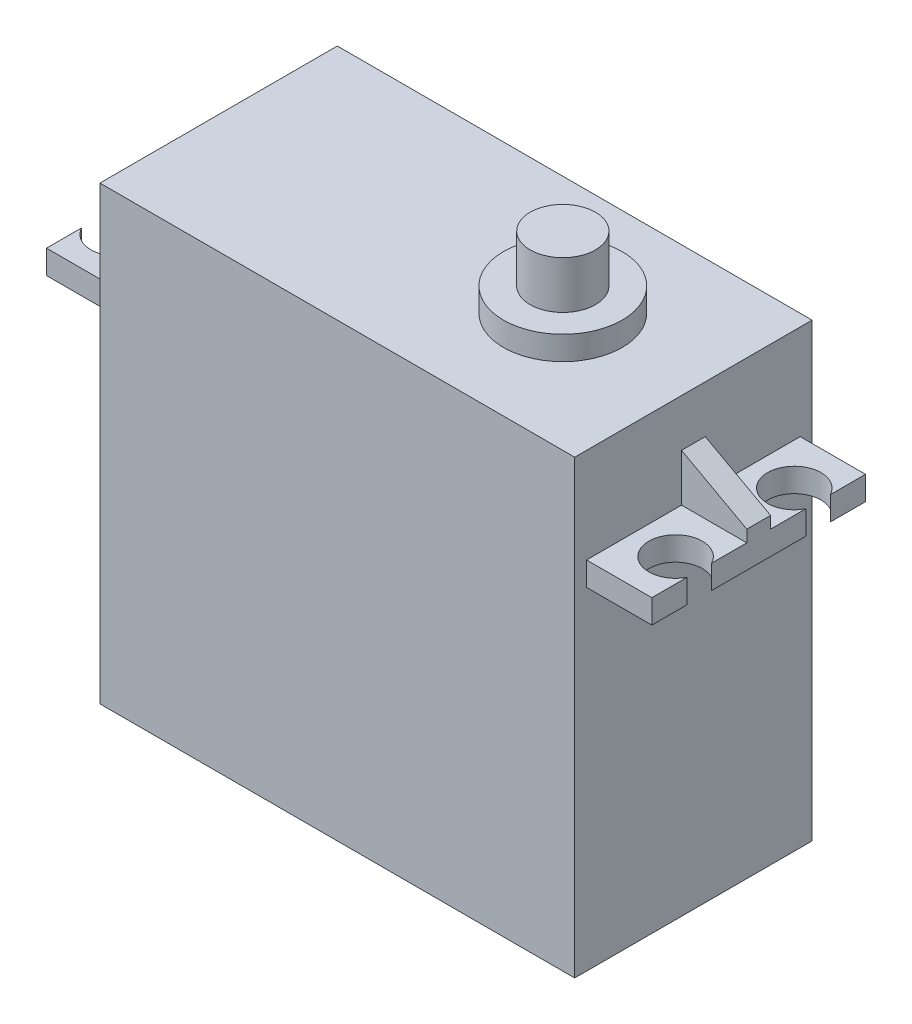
ISO-10303-21;
HEADER;
FILE_DESCRIPTION(('STEP AP214'),'2;1');
FILE_NAME('part.step','',(''),(''),'','','');
FILE_SCHEMA(('AUTOMOTIVE_DESIGN { 1 0 10303 214 1 1 1 1 }'));
ENDSEC;
DATA;
#1=APPLICATION_CONTEXT('core data for automotive mechanical design processes');
#2=APPLICATION_PROTOCOL_DEFINITION('international standard','automotive_design',2000,#1);
#3=PRODUCT_CONTEXT('',#1,'mechanical');
#4=PRODUCT('Part','Part','',(#3));
#5=PRODUCT_RELATED_PRODUCT_CATEGORY('part','',(#4));
#6=PRODUCT_DEFINITION_FORMATION('','',#4);
#7=PRODUCT_DEFINITION_CONTEXT('part definition',#1,'design');
#8=PRODUCT_DEFINITION('design','',#6,#7);
#9=PRODUCT_DEFINITION_SHAPE('','',#8);
#10=(LENGTH_UNIT() NAMED_UNIT(*) SI_UNIT(.MILLI.,.METRE.));
#11=(NAMED_UNIT(*) PLANE_ANGLE_UNIT() SI_UNIT($,.RADIAN.));
#12=(NAMED_UNIT(*) SI_UNIT($,.STERADIAN.) SOLID_ANGLE_UNIT());
#13=UNCERTAINTY_MEASURE_WITH_UNIT(LENGTH_MEASURE(1.E-05),#10,'distance_accuracy_value','');
#14=(GEOMETRIC_REPRESENTATION_CONTEXT(3) GLOBAL_UNCERTAINTY_ASSIGNED_CONTEXT((#13)) GLOBAL_UNIT_ASSIGNED_CONTEXT((#10,
#11,#12)) REPRESENTATION_CONTEXT('',''));
#15=CARTESIAN_POINT('',(0.,0.,0.));
#16=DIRECTION('',(0.,0.,1.));
#17=DIRECTION('',(1.,0.,0.));
#18=AXIS2_PLACEMENT_3D('',#15,#16,#17);
#19=CARTESIAN_POINT('',(0.,30.,0.));
#20=DIRECTION('',(0.,1.,0.));
#21=DIRECTION('',(0.,0.,1.));
#22=AXIS2_PLACEMENT_3D('',#19,#20,#21);
#23=PLANE('',#22);
#24=DIRECTION('',(0.,0.,-1.));
#25=VECTOR('',#24,1.);
#26=CARTESIAN_POINT('',(20.,30.,0.));
#27=LINE('',#26,#25);
#28=CARTESIAN_POINT('',(20.,30.,-1.));
#29=VERTEX_POINT('',#28);
#30=CARTESIAN_POINT('',(20.,30.,-9.));
#31=VERTEX_POINT('',#30);
#32=EDGE_CURVE('E296',#29,#31,#27,.T.);
#33=ORIENTED_EDGE('',*,*,#32,.F.);
#34=DIRECTION('',(1.,0.,0.));
#35=VECTOR('',#34,1.);
#36=CARTESIAN_POINT('',(0.,30.,-1.));
#37=LINE('',#36,#35);
#38=CARTESIAN_POINT('',(25.5,30.,-1.));
#39=VERTEX_POINT('',#38);
#40=EDGE_CURVE('E244',#29,#39,#37,.T.);
#41=ORIENTED_EDGE('',*,*,#40,.T.);
#42=DIRECTION('',(0.,0.,1.));
#43=VECTOR('',#42,1.);
#44=CARTESIAN_POINT('',(25.5,30.,0.));
#45=LINE('',#44,#43);
#46=CARTESIAN_POINT('',(25.5,30.,-3.96922359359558));
#47=VERTEX_POINT('',#46);
#48=EDGE_CURVE('E287',#47,#39,#45,.T.);
#49=ORIENTED_EDGE('',*,*,#48,.F.);
#50=CARTESIAN_POINT('',(23.5,30.,-5.));
#51=DIRECTION('',(0.,1.,0.));
#52=DIRECTION('',(0.,0.,1.));
#53=AXIS2_PLACEMENT_3D('',#50,#51,#52);
#54=CIRCLE('',#53,2.25);
#55=CARTESIAN_POINT('',(25.5,30.,-6.03077640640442));
#56=VERTEX_POINT('',#55);
#57=EDGE_CURVE('E289',#47,#56,#54,.F.);
#58=ORIENTED_EDGE('',*,*,#57,.T.);
#59=CARTESIAN_POINT('',(25.5,30.,-9.));
#60=VERTEX_POINT('',#59);
#61=EDGE_CURVE('E291',#60,#56,#45,.T.);
#62=ORIENTED_EDGE('',*,*,#61,.F.);
#63=DIRECTION('',(1.,0.,0.));
#64=VECTOR('',#63,1.);
#65=CARTESIAN_POINT('',(0.,30.,-9.));
#66=LINE('',#65,#64);
#67=EDGE_CURVE('E293',#31,#60,#66,.T.);
#68=ORIENTED_EDGE('',*,*,#67,.F.);
#69=EDGE_LOOP('',(#33,#41,#49,#58,#62,#68));
#70=FACE_BOUND('',#69,.T.);
#71=ADVANCED_FACE('F39',(#70),#23,.T.);
#72=CARTESIAN_POINT('',(0.,30.,0.));
#73=DIRECTION('',(0.,1.,0.));
#74=DIRECTION('',(0.,0.,1.));
#75=AXIS2_PLACEMENT_3D('',#72,#73,#74);
#76=PLANE('',#75);
#77=DIRECTION('',(0.,0.,1.));
#78=VECTOR('',#77,1.);
#79=CARTESIAN_POINT('',(-25.5,30.,0.));
#80=LINE('',#79,#78);
#81=CARTESIAN_POINT('',(-25.5,30.,-3.96922359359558));
#82=VERTEX_POINT('',#81);
#83=CARTESIAN_POINT('',(-25.5,30.,-1.));
#84=VERTEX_POINT('',#83);
#85=EDGE_CURVE('E342',#82,#84,#80,.T.);
#86=ORIENTED_EDGE('',*,*,#85,.T.);
#87=DIRECTION('',(1.,0.,0.));
#88=VECTOR('',#87,1.);
#89=CARTESIAN_POINT('',(0.,30.,-1.));
#90=LINE('',#89,#88);
#91=CARTESIAN_POINT('',(-20.,30.,-1.));
#92=VERTEX_POINT('',#91);
#93=EDGE_CURVE('E275',#84,#92,#90,.T.);
#94=ORIENTED_EDGE('',*,*,#93,.T.);
#95=DIRECTION('',(0.,0.,1.));
#96=VECTOR('',#95,1.);
#97=CARTESIAN_POINT('',(-20.,30.,0.));
#98=LINE('',#97,#96);
#99=CARTESIAN_POINT('',(-20.,30.,-9.));
#100=VERTEX_POINT('',#99);
#101=EDGE_CURVE('E353',#100,#92,#98,.T.);
#102=ORIENTED_EDGE('',*,*,#101,.F.);
#103=DIRECTION('',(-1.,0.,0.));
#104=VECTOR('',#103,1.);
#105=CARTESIAN_POINT('',(0.,30.,-9.));
#106=LINE('',#105,#104);
#107=CARTESIAN_POINT('',(-25.5,30.,-9.));
#108=VERTEX_POINT('',#107);
#109=EDGE_CURVE('E356',#100,#108,#106,.T.);
#110=ORIENTED_EDGE('',*,*,#109,.T.);
#111=CARTESIAN_POINT('',(-25.5,30.,-6.03077640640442));
#112=VERTEX_POINT('',#111);
#113=EDGE_CURVE('E358',#108,#112,#80,.T.);
#114=ORIENTED_EDGE('',*,*,#113,.T.);
#115=CARTESIAN_POINT('',(-23.5,30.,-5.));
#116=DIRECTION('',(0.,1.,0.));
#117=DIRECTION('',(0.,0.,1.));
#118=AXIS2_PLACEMENT_3D('',#115,#116,#117);
#119=CIRCLE('',#118,2.25);
#120=EDGE_CURVE('E359',#82,#112,#119,.T.);
#121=ORIENTED_EDGE('',*,*,#120,.F.);
#122=EDGE_LOOP('',(#86,#94,#102,#110,#114,#121));
#123=FACE_BOUND('',#122,.T.);
#124=ADVANCED_FACE('F467',(#123),#76,.T.);
#125=CARTESIAN_POINT('',(20.,38.,10.));
#126=DIRECTION('',(-1.,0.,0.));
#127=DIRECTION('',(0.,0.,1.));
#128=AXIS2_PLACEMENT_3D('',#125,#126,#127);
#129=PLANE('',#128);
#130=DIRECTION('',(0.,-1.,0.));
#131=VECTOR('',#130,1.);
#132=CARTESIAN_POINT('',(20.,30.,-9.));
#133=LINE('',#132,#131);
#134=CARTESIAN_POINT('',(20.,28.,-9.));
#135=VERTEX_POINT('',#134);
#136=EDGE_CURVE('E332',#31,#135,#133,.T.);
#137=ORIENTED_EDGE('',*,*,#136,.T.);
#138=DIRECTION('',(0.,0.,-1.));
#139=VECTOR('',#138,1.);
#140=CARTESIAN_POINT('',(20.,28.,0.));
#141=LINE('',#140,#139);
#142=CARTESIAN_POINT('',(20.,28.,9.));
#143=VERTEX_POINT('',#142);
#144=EDGE_CURVE('E316',#143,#135,#141,.T.);
#145=ORIENTED_EDGE('',*,*,#144,.F.);
#146=DIRECTION('',(0.,-1.,0.));
#147=VECTOR('',#146,1.);
#148=CARTESIAN_POINT('',(20.,30.,9.));
#149=LINE('',#148,#147);
#150=CARTESIAN_POINT('',(20.,30.,9.));
#151=VERTEX_POINT('',#150);
#152=EDGE_CURVE('E329',#151,#143,#149,.T.);
#153=ORIENTED_EDGE('',*,*,#152,.F.);
#154=CARTESIAN_POINT('',(20.,30.,1.));
#155=VERTEX_POINT('',#154);
#156=EDGE_CURVE('E297',#151,#155,#27,.T.);
#157=ORIENTED_EDGE('',*,*,#156,.T.);
#158=DIRECTION('',(0.,1.,0.));
#159=VECTOR('',#158,1.);
#160=CARTESIAN_POINT('',(20.,38.,0.999999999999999));
#161=LINE('',#160,#159);
#162=CARTESIAN_POINT('',(20.,34.,1.));
#163=VERTEX_POINT('',#162);
#164=EDGE_CURVE('E259',#155,#163,#161,.T.);
#165=ORIENTED_EDGE('',*,*,#164,.T.);
#166=DIRECTION('',(0.,0.,-1.));
#167=VECTOR('',#166,1.);
#168=CARTESIAN_POINT('',(20.,34.,10.));
#169=LINE('',#168,#167);
#170=CARTESIAN_POINT('',(20.,34.,-1.));
#171=VERTEX_POINT('',#170);
#172=EDGE_CURVE('E248',#163,#171,#169,.T.);
#173=ORIENTED_EDGE('',*,*,#172,.T.);
#174=DIRECTION('',(0.,1.,0.));
#175=VECTOR('',#174,1.);
#176=CARTESIAN_POINT('',(20.,38.,-0.999999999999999));
#177=LINE('',#176,#175);
#178=EDGE_CURVE('E256',#29,#171,#177,.T.);
#179=ORIENTED_EDGE('',*,*,#178,.F.);
#180=ORIENTED_EDGE('',*,*,#32,.T.);
#181=EDGE_LOOP('',(#137,#145,#153,#157,#165,#173,#179,#180));
#182=FACE_BOUND('',#181,.T.);
#183=DIRECTION('',(0.,0.,-1.));
#184=VECTOR('',#183,1.);
#185=CARTESIAN_POINT('',(20.,0.,10.));
#186=LINE('',#185,#184);
#187=CARTESIAN_POINT('',(20.,0.,10.));
#188=VERTEX_POINT('',#187);
#189=CARTESIAN_POINT('',(20.,0.,-10.));
#190=VERTEX_POINT('',#189);
#191=EDGE_CURVE('E398',#188,#190,#186,.T.);
#192=ORIENTED_EDGE('',*,*,#191,.T.);
#193=DIRECTION('',(0.,-1.,0.));
#194=VECTOR('',#193,1.);
#195=CARTESIAN_POINT('',(20.,38.,-10.));
#196=LINE('',#195,#194);
#197=CARTESIAN_POINT('',(20.,38.,-10.));
#198=VERTEX_POINT('',#197);
#199=EDGE_CURVE('E422',#198,#190,#196,.T.);
#200=ORIENTED_EDGE('',*,*,#199,.F.);
#201=DIRECTION('',(0.,0.,-1.));
#202=VECTOR('',#201,1.);
#203=CARTESIAN_POINT('',(20.,38.,10.));
#204=LINE('',#203,#202);
#205=CARTESIAN_POINT('',(20.,38.,10.));
#206=VERTEX_POINT('',#205);
#207=EDGE_CURVE('E399',#206,#198,#204,.T.);
#208=ORIENTED_EDGE('',*,*,#207,.F.);
#209=DIRECTION('',(0.,-1.,0.));
#210=VECTOR('',#209,1.);
#211=CARTESIAN_POINT('',(20.,38.,10.));
#212=LINE('',#211,#210);
#213=EDGE_CURVE('E408',#206,#188,#212,.T.);
#214=ORIENTED_EDGE('',*,*,#213,.T.);
#215=EDGE_LOOP('',(#192,#200,#208,#214));
#216=FACE_BOUND('',#215,.T.);
#217=ADVANCED_FACE('F41',(#182,#216),#129,.F.);
#218=CARTESIAN_POINT('',(-20.,38.,-10.));
#219=DIRECTION('',(0.,0.,1.));
#220=DIRECTION('',(1.,0.,0.));
#221=AXIS2_PLACEMENT_3D('',#218,#219,#220);
#222=PLANE('',#221);
#223=DIRECTION('',(-1.,0.,0.));
#224=VECTOR('',#223,1.);
#225=CARTESIAN_POINT('',(-20.,0.,-10.));
#226=LINE('',#225,#224);
#227=CARTESIAN_POINT('',(-20.,0.,-10.));
#228=VERTEX_POINT('',#227);
#229=EDGE_CURVE('E410',#190,#228,#226,.T.);
#230=ORIENTED_EDGE('',*,*,#229,.T.);
#231=DIRECTION('',(0.,-1.,0.));
#232=VECTOR('',#231,1.);
#233=CARTESIAN_POINT('',(-20.,38.,-10.));
#234=LINE('',#233,#232);
#235=CARTESIAN_POINT('',(-20.,38.,-10.));
#236=VERTEX_POINT('',#235);
#237=EDGE_CURVE('E420',#236,#228,#234,.T.);
#238=ORIENTED_EDGE('',*,*,#237,.F.);
#239=DIRECTION('',(-1.,0.,0.));
#240=VECTOR('',#239,1.);
#241=CARTESIAN_POINT('',(-20.,38.,-10.));
#242=LINE('',#241,#240);
#243=EDGE_CURVE('E401',#198,#236,#242,.T.);
#244=ORIENTED_EDGE('',*,*,#243,.F.);
#245=ORIENTED_EDGE('',*,*,#199,.T.);
#246=EDGE_LOOP('',(#230,#238,#244,#245));
#247=FACE_BOUND('',#246,.T.);
#248=ADVANCED_FACE('F451',(#247),#222,.F.);
#249=CARTESIAN_POINT('',(-20.,38.,10.));
#250=DIRECTION('',(1.,0.,0.));
#251=DIRECTION('',(0.,0.,-1.));
#252=AXIS2_PLACEMENT_3D('',#249,#250,#251);
#253=PLANE('',#252);
#254=DIRECTION('',(0.,0.,-1.));
#255=VECTOR('',#254,1.);
#256=CARTESIAN_POINT('',(-20.,34.,10.));
#257=LINE('',#256,#255);
#258=CARTESIAN_POINT('',(-20.,34.,-1.));
#259=VERTEX_POINT('',#258);
#260=CARTESIAN_POINT('',(-20.,34.,1.));
#261=VERTEX_POINT('',#260);
#262=EDGE_CURVE('E282',#259,#261,#257,.F.);
#263=ORIENTED_EDGE('',*,*,#262,.T.);
#264=DIRECTION('',(0.,-1.,0.));
#265=VECTOR('',#264,1.);
#266=CARTESIAN_POINT('',(-20.,38.,0.999999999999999));
#267=LINE('',#266,#265);
#268=CARTESIAN_POINT('',(-20.,30.,1.));
#269=VERTEX_POINT('',#268);
#270=EDGE_CURVE('E279',#261,#269,#267,.T.);
#271=ORIENTED_EDGE('',*,*,#270,.T.);
#272=CARTESIAN_POINT('',(-20.,30.,9.));
#273=VERTEX_POINT('',#272);
#274=EDGE_CURVE('E352',#269,#273,#98,.T.);
#275=ORIENTED_EDGE('',*,*,#274,.T.);
#276=DIRECTION('',(0.,-1.,0.));
#277=VECTOR('',#276,1.);
#278=CARTESIAN_POINT('',(-20.,30.,9.));
#279=LINE('',#278,#277);
#280=CARTESIAN_POINT('',(-20.,28.,9.));
#281=VERTEX_POINT('',#280);
#282=EDGE_CURVE('E387',#273,#281,#279,.T.);
#283=ORIENTED_EDGE('',*,*,#282,.T.);
#284=DIRECTION('',(0.,0.,1.));
#285=VECTOR('',#284,1.);
#286=CARTESIAN_POINT('',(-20.,28.,0.));
#287=LINE('',#286,#285);
#288=CARTESIAN_POINT('',(-20.,28.,-9.));
#289=VERTEX_POINT('',#288);
#290=EDGE_CURVE('E371',#289,#281,#287,.T.);
#291=ORIENTED_EDGE('',*,*,#290,.F.);
#292=DIRECTION('',(0.,-1.,0.));
#293=VECTOR('',#292,1.);
#294=CARTESIAN_POINT('',(-20.,30.,-9.));
#295=LINE('',#294,#293);
#296=EDGE_CURVE('E384',#100,#289,#295,.T.);
#297=ORIENTED_EDGE('',*,*,#296,.F.);
#298=ORIENTED_EDGE('',*,*,#101,.T.);
#299=DIRECTION('',(0.,-1.,0.));
#300=VECTOR('',#299,1.);
#301=CARTESIAN_POINT('',(-20.,38.,-0.999999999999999));
#302=LINE('',#301,#300);
#303=EDGE_CURVE('E63',#259,#92,#302,.T.);
#304=ORIENTED_EDGE('',*,*,#303,.F.);
#305=EDGE_LOOP('',(#263,#271,#275,#283,#291,#297,#298,#304));
#306=FACE_BOUND('',#305,.T.);
#307=DIRECTION('',(0.,-1.,0.));
#308=VECTOR('',#307,1.);
#309=CARTESIAN_POINT('',(-20.,38.,10.));
#310=LINE('',#309,#308);
#311=CARTESIAN_POINT('',(-20.,38.,10.));
#312=VERTEX_POINT('',#311);
#313=CARTESIAN_POINT('',(-20.,0.,10.));
#314=VERTEX_POINT('',#313);
#315=EDGE_CURVE('E417',#312,#314,#310,.T.);
#316=ORIENTED_EDGE('',*,*,#315,.F.);
#317=DIRECTION('',(0.,0.,1.));
#318=VECTOR('',#317,1.);
#319=CARTESIAN_POINT('',(-20.,38.,10.));
#320=LINE('',#319,#318);
#321=EDGE_CURVE('E404',#236,#312,#320,.T.);
#322=ORIENTED_EDGE('',*,*,#321,.F.);
#323=ORIENTED_EDGE('',*,*,#237,.T.);
#324=DIRECTION('',(0.,0.,1.));
#325=VECTOR('',#324,1.);
#326=CARTESIAN_POINT('',(-20.,0.,10.));
#327=LINE('',#326,#325);
#328=EDGE_CURVE('E412',#228,#314,#327,.T.);
#329=ORIENTED_EDGE('',*,*,#328,.T.);
#330=EDGE_LOOP('',(#316,#322,#323,#329));
#331=FACE_BOUND('',#330,.T.);
#332=ADVANCED_FACE('F444',(#306,#331),#253,.F.);
#333=CARTESIAN_POINT('',(-20.,38.,10.));
#334=DIRECTION('',(0.,0.,-1.));
#335=DIRECTION('',(-1.,0.,0.));
#336=AXIS2_PLACEMENT_3D('',#333,#334,#335);
#337=PLANE('',#336);
#338=DIRECTION('',(1.,0.,0.));
#339=VECTOR('',#338,1.);
#340=CARTESIAN_POINT('',(-20.,0.,10.));
#341=LINE('',#340,#339);
#342=EDGE_CURVE('E402',#314,#188,#341,.T.);
#343=ORIENTED_EDGE('',*,*,#342,.T.);
#344=ORIENTED_EDGE('',*,*,#213,.F.);
#345=DIRECTION('',(1.,0.,0.));
#346=VECTOR('',#345,1.);
#347=CARTESIAN_POINT('',(-20.,38.,10.));
#348=LINE('',#347,#346);
#349=EDGE_CURVE('E406',#312,#206,#348,.T.);
#350=ORIENTED_EDGE('',*,*,#349,.F.);
#351=ORIENTED_EDGE('',*,*,#315,.T.);
#352=EDGE_LOOP('',(#343,#344,#350,#351));
#353=FACE_BOUND('',#352,.T.);
#354=ADVANCED_FACE('F436',(#353),#337,.F.);
#355=CARTESIAN_POINT('',(0.,38.,0.));
#356=DIRECTION('',(0.,-1.,0.));
#357=DIRECTION('',(0.,0.,-1.));
#358=AXIS2_PLACEMENT_3D('',#355,#356,#357);
#359=PLANE('',#358);
#360=CARTESIAN_POINT('',(9.,38.,0.));
#361=DIRECTION('',(0.,-1.,0.));
#362=DIRECTION('',(0.,0.,-1.));
#363=AXIS2_PLACEMENT_3D('',#360,#361,#362);
#364=CIRCLE('',#363,5.);
#365=CARTESIAN_POINT('',(9.,38.,-5.));
#366=VERTEX_POINT('',#365);
#367=EDGE_CURVE('E43',#366,#366,#364,.F.);
#368=ORIENTED_EDGE('',*,*,#367,.F.);
#369=EDGE_LOOP('',(#368));
#370=FACE_BOUND('',#369,.T.);
#371=ORIENTED_EDGE('',*,*,#321,.T.);
#372=ORIENTED_EDGE('',*,*,#349,.T.);
#373=ORIENTED_EDGE('',*,*,#207,.T.);
#374=ORIENTED_EDGE('',*,*,#243,.T.);
#375=EDGE_LOOP('',(#371,#372,#373,#374));
#376=FACE_BOUND('',#375,.T.);
#377=ADVANCED_FACE('F432',(#370,#376),#359,.F.);
#378=CARTESIAN_POINT('',(0.,0.,0.));
#379=DIRECTION('',(0.,-1.,0.));
#380=DIRECTION('',(0.,0.,-1.));
#381=AXIS2_PLACEMENT_3D('',#378,#379,#380);
#382=PLANE('',#381);
#383=ORIENTED_EDGE('',*,*,#342,.F.);
#384=ORIENTED_EDGE('',*,*,#328,.F.);
#385=ORIENTED_EDGE('',*,*,#229,.F.);
#386=ORIENTED_EDGE('',*,*,#191,.F.);
#387=EDGE_LOOP('',(#383,#384,#385,#386));
#388=FACE_BOUND('',#387,.T.);
#389=ADVANCED_FACE('F435',(#388),#382,.T.);
#390=CARTESIAN_POINT('',(-25.5,30.,0.));
#391=DIRECTION('',(1.,0.,0.));
#392=DIRECTION('',(0.,0.,-1.));
#393=AXIS2_PLACEMENT_3D('',#390,#391,#392);
#394=PLANE('',#393);
#395=CARTESIAN_POINT('',(-25.5,30.,1.));
#396=VERTEX_POINT('',#395);
#397=CARTESIAN_POINT('',(-25.5,30.,3.96922359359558));
#398=VERTEX_POINT('',#397);
#399=EDGE_CURVE('E346',#396,#398,#80,.T.);
#400=ORIENTED_EDGE('',*,*,#399,.F.);
#401=DIRECTION('',(0.,1.,0.));
#402=VECTOR('',#401,1.);
#403=CARTESIAN_POINT('',(-25.5,19.,1.));
#404=LINE('',#403,#402);
#405=CARTESIAN_POINT('',(-25.5,31.,1.));
#406=VERTEX_POINT('',#405);
#407=EDGE_CURVE('E264',#396,#406,#404,.T.);
#408=ORIENTED_EDGE('',*,*,#407,.T.);
#409=DIRECTION('',(0.,0.,1.));
#410=VECTOR('',#409,1.);
#411=CARTESIAN_POINT('',(-25.5,31.,0.));
#412=LINE('',#411,#410);
#413=CARTESIAN_POINT('',(-25.5,31.,-1.));
#414=VERTEX_POINT('',#413);
#415=EDGE_CURVE('E266',#414,#406,#412,.T.);
#416=ORIENTED_EDGE('',*,*,#415,.F.);
#417=DIRECTION('',(0.,1.,0.));
#418=VECTOR('',#417,1.);
#419=CARTESIAN_POINT('',(-25.5,19.,-1.));
#420=LINE('',#419,#418);
#421=EDGE_CURVE('E270',#84,#414,#420,.T.);
#422=ORIENTED_EDGE('',*,*,#421,.F.);
#423=ORIENTED_EDGE('',*,*,#85,.F.);
#424=DIRECTION('',(0.,-1.,0.));
#425=VECTOR('',#424,1.);
#426=CARTESIAN_POINT('',(-25.5,30.,-3.96922359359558));
#427=LINE('',#426,#425);
#428=CARTESIAN_POINT('',(-25.5,28.,-3.96922359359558));
#429=VERTEX_POINT('',#428);
#430=EDGE_CURVE('E362',#82,#429,#427,.T.);
#431=ORIENTED_EDGE('',*,*,#430,.T.);
#432=DIRECTION('',(0.,0.,1.));
#433=VECTOR('',#432,1.);
#434=CARTESIAN_POINT('',(-25.5,28.,0.));
#435=LINE('',#434,#433);
#436=CARTESIAN_POINT('',(-25.5,28.,3.96922359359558));
#437=VERTEX_POINT('',#436);
#438=EDGE_CURVE('E341',#429,#437,#435,.T.);
#439=ORIENTED_EDGE('',*,*,#438,.T.);
#440=DIRECTION('',(0.,-1.,0.));
#441=VECTOR('',#440,1.);
#442=CARTESIAN_POINT('',(-25.5,30.,3.96922359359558));
#443=LINE('',#442,#441);
#444=EDGE_CURVE('E395',#398,#437,#443,.T.);
#445=ORIENTED_EDGE('',*,*,#444,.F.);
#446=EDGE_LOOP('',(#400,#408,#416,#422,#423,#431,#439,#445));
#447=FACE_BOUND('',#446,.T.);
#448=ADVANCED_FACE('F455',(#447),#394,.F.);
#449=CARTESIAN_POINT('',(-23.5,30.,5.));
#450=DIRECTION('',(0.,-1.,0.));
#451=DIRECTION('',(0.,0.,-1.));
#452=AXIS2_PLACEMENT_3D('',#449,#450,#451);
#453=CYLINDRICAL_SURFACE('',#452,2.25);
#454=CARTESIAN_POINT('',(-23.5,28.,5.));
#455=DIRECTION('',(0.,1.,0.));
#456=DIRECTION('',(0.,0.,1.));
#457=AXIS2_PLACEMENT_3D('',#454,#455,#456);
#458=CIRCLE('',#457,2.25);
#459=CARTESIAN_POINT('',(-25.5,28.,6.03077640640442));
#460=VERTEX_POINT('',#459);
#461=EDGE_CURVE('E364',#437,#460,#458,.F.);
#462=ORIENTED_EDGE('',*,*,#461,.T.);
#463=DIRECTION('',(0.,-1.,0.));
#464=VECTOR('',#463,1.);
#465=CARTESIAN_POINT('',(-25.5,30.,6.03077640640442));
#466=LINE('',#465,#464);
#467=CARTESIAN_POINT('',(-25.5,30.,6.03077640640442));
#468=VERTEX_POINT('',#467);
#469=EDGE_CURVE('E392',#468,#460,#466,.T.);
#470=ORIENTED_EDGE('',*,*,#469,.F.);
#471=CARTESIAN_POINT('',(-23.5,30.,5.));
#472=DIRECTION('',(0.,1.,0.));
#473=DIRECTION('',(0.,0.,1.));
#474=AXIS2_PLACEMENT_3D('',#471,#472,#473);
#475=CIRCLE('',#474,2.25);
#476=EDGE_CURVE('E345',#398,#468,#475,.F.);
#477=ORIENTED_EDGE('',*,*,#476,.F.);
#478=ORIENTED_EDGE('',*,*,#444,.T.);
#479=EDGE_LOOP('',(#462,#470,#477,#478));
#480=FACE_BOUND('',#479,.T.);
#481=ADVANCED_FACE('F460',(#480),#453,.F.);
#482=CARTESIAN_POINT('',(-25.5,28.,9.));
#483=VERTEX_POINT('',#482);
#484=EDGE_CURVE('E366',#460,#483,#435,.T.);
#485=ORIENTED_EDGE('',*,*,#484,.T.);
#486=DIRECTION('',(0.,-1.,0.));
#487=VECTOR('',#486,1.);
#488=CARTESIAN_POINT('',(-25.5,30.,9.));
#489=LINE('',#488,#487);
#490=CARTESIAN_POINT('',(-25.5,30.,9.));
#491=VERTEX_POINT('',#490);
#492=EDGE_CURVE('E390',#491,#483,#489,.T.);
#493=ORIENTED_EDGE('',*,*,#492,.F.);
#494=EDGE_CURVE('E347',#468,#491,#80,.T.);
#495=ORIENTED_EDGE('',*,*,#494,.F.);
#496=ORIENTED_EDGE('',*,*,#469,.T.);
#497=EDGE_LOOP('',(#485,#493,#495,#496));
#498=FACE_BOUND('',#497,.T.);
#499=ADVANCED_FACE('F463',(#498),#394,.F.);
#500=CARTESIAN_POINT('',(0.,30.,9.));
#501=DIRECTION('',(0.,0.,1.));
#502=DIRECTION('',(1.,0.,0.));
#503=AXIS2_PLACEMENT_3D('',#500,#501,#502);
#504=PLANE('',#503);
#505=DIRECTION('',(-1.,0.,0.));
#506=VECTOR('',#505,1.);
#507=CARTESIAN_POINT('',(0.,28.,9.));
#508=LINE('',#507,#506);
#509=EDGE_CURVE('E368',#281,#483,#508,.T.);
#510=ORIENTED_EDGE('',*,*,#509,.F.);
#511=ORIENTED_EDGE('',*,*,#282,.F.);
#512=DIRECTION('',(-1.,0.,0.));
#513=VECTOR('',#512,1.);
#514=CARTESIAN_POINT('',(0.,30.,9.));
#515=LINE('',#514,#513);
#516=EDGE_CURVE('E349',#273,#491,#515,.T.);
#517=ORIENTED_EDGE('',*,*,#516,.T.);
#518=ORIENTED_EDGE('',*,*,#492,.T.);
#519=EDGE_LOOP('',(#510,#511,#517,#518));
#520=FACE_BOUND('',#519,.T.);
#521=ADVANCED_FACE('F560',(#520),#504,.T.);
#522=CARTESIAN_POINT('',(0.,30.,-9.));
#523=DIRECTION('',(0.,0.,1.));
#524=DIRECTION('',(1.,0.,0.));
#525=AXIS2_PLACEMENT_3D('',#522,#523,#524);
#526=PLANE('',#525);
#527=DIRECTION('',(-1.,0.,0.));
#528=VECTOR('',#527,1.);
#529=CARTESIAN_POINT('',(0.,28.,-9.));
#530=LINE('',#529,#528);
#531=CARTESIAN_POINT('',(-25.5,28.,-9.));
#532=VERTEX_POINT('',#531);
#533=EDGE_CURVE('E373',#289,#532,#530,.T.);
#534=ORIENTED_EDGE('',*,*,#533,.T.);
#535=DIRECTION('',(0.,-1.,0.));
#536=VECTOR('',#535,1.);
#537=CARTESIAN_POINT('',(-25.5,30.,-9.));
#538=LINE('',#537,#536);
#539=EDGE_CURVE('E381',#108,#532,#538,.T.);
#540=ORIENTED_EDGE('',*,*,#539,.F.);
#541=ORIENTED_EDGE('',*,*,#109,.F.);
#542=ORIENTED_EDGE('',*,*,#296,.T.);
#543=EDGE_LOOP('',(#534,#540,#541,#542));
#544=FACE_BOUND('',#543,.T.);
#545=ADVANCED_FACE('F556',(#544),#526,.F.);
#546=CARTESIAN_POINT('',(-25.5,28.,-6.03077640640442));
#547=VERTEX_POINT('',#546);
#548=EDGE_CURVE('E365',#532,#547,#435,.T.);
#549=ORIENTED_EDGE('',*,*,#548,.T.);
#550=DIRECTION('',(0.,-1.,0.));
#551=VECTOR('',#550,1.);
#552=CARTESIAN_POINT('',(-25.5,30.,-6.03077640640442));
#553=LINE('',#552,#551);
#554=EDGE_CURVE('E379',#112,#547,#553,.T.);
#555=ORIENTED_EDGE('',*,*,#554,.F.);
#556=ORIENTED_EDGE('',*,*,#113,.F.);
#557=ORIENTED_EDGE('',*,*,#539,.T.);
#558=EDGE_LOOP('',(#549,#555,#556,#557));
#559=FACE_BOUND('',#558,.T.);
#560=ADVANCED_FACE('F464',(#559),#394,.F.);
#561=CARTESIAN_POINT('',(-23.5,30.,-5.));
#562=DIRECTION('',(0.,-1.,0.));
#563=DIRECTION('',(0.,0.,-1.));
#564=AXIS2_PLACEMENT_3D('',#561,#562,#563);
#565=CYLINDRICAL_SURFACE('',#564,2.25);
#566=CARTESIAN_POINT('',(-23.5,28.,-5.));
#567=DIRECTION('',(0.,1.,0.));
#568=DIRECTION('',(0.,0.,1.));
#569=AXIS2_PLACEMENT_3D('',#566,#567,#568);
#570=CIRCLE('',#569,2.25);
#571=EDGE_CURVE('E375',#429,#547,#570,.T.);
#572=ORIENTED_EDGE('',*,*,#571,.F.);
#573=ORIENTED_EDGE('',*,*,#430,.F.);
#574=ORIENTED_EDGE('',*,*,#120,.T.);
#575=ORIENTED_EDGE('',*,*,#554,.T.);
#576=EDGE_LOOP('',(#572,#573,#574,#575));
#577=FACE_BOUND('',#576,.T.);
#578=ADVANCED_FACE('F547',(#577),#565,.F.);
#579=DIRECTION('',(1.,0.,0.));
#580=VECTOR('',#579,1.);
#581=CARTESIAN_POINT('',(0.,30.,1.));
#582=LINE('',#581,#580);
#583=EDGE_CURVE('E277',#396,#269,#582,.T.);
#584=ORIENTED_EDGE('',*,*,#583,.F.);
#585=ORIENTED_EDGE('',*,*,#399,.T.);
#586=ORIENTED_EDGE('',*,*,#476,.T.);
#587=ORIENTED_EDGE('',*,*,#494,.T.);
#588=ORIENTED_EDGE('',*,*,#516,.F.);
#589=ORIENTED_EDGE('',*,*,#274,.F.);
#590=EDGE_LOOP('',(#584,#585,#586,#587,#588,#589));
#591=FACE_BOUND('',#590,.T.);
#592=ADVANCED_FACE('F476',(#591),#76,.T.);
#593=CARTESIAN_POINT('',(0.,28.,0.));
#594=DIRECTION('',(0.,1.,0.));
#595=DIRECTION('',(0.,0.,1.));
#596=AXIS2_PLACEMENT_3D('',#593,#594,#595);
#597=PLANE('',#596);
#598=ORIENTED_EDGE('',*,*,#461,.F.);
#599=ORIENTED_EDGE('',*,*,#438,.F.);
#600=ORIENTED_EDGE('',*,*,#571,.T.);
#601=ORIENTED_EDGE('',*,*,#548,.F.);
#602=ORIENTED_EDGE('',*,*,#533,.F.);
#603=ORIENTED_EDGE('',*,*,#290,.T.);
#604=ORIENTED_EDGE('',*,*,#509,.T.);
#605=ORIENTED_EDGE('',*,*,#484,.F.);
#606=EDGE_LOOP('',(#598,#599,#600,#601,#602,#603,#604,#605));
#607=FACE_BOUND('',#606,.T.);
#608=ADVANCED_FACE('F535',(#607),#597,.F.);
#609=CARTESIAN_POINT('',(25.5,30.,0.));
#610=DIRECTION('',(1.,0.,0.));
#611=DIRECTION('',(0.,0.,-1.));
#612=AXIS2_PLACEMENT_3D('',#609,#610,#611);
#613=PLANE('',#612);
#614=DIRECTION('',(0.,-1.,0.));
#615=VECTOR('',#614,1.);
#616=CARTESIAN_POINT('',(25.5,30.,3.96922359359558));
#617=LINE('',#616,#615);
#618=CARTESIAN_POINT('',(25.5,30.,3.96922359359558));
#619=VERTEX_POINT('',#618);
#620=CARTESIAN_POINT('',(25.5,28.,3.96922359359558));
#621=VERTEX_POINT('',#620);
#622=EDGE_CURVE('E306',#619,#621,#617,.T.);
#623=ORIENTED_EDGE('',*,*,#622,.T.);
#624=DIRECTION('',(0.,0.,1.));
#625=VECTOR('',#624,1.);
#626=CARTESIAN_POINT('',(25.5,28.,0.));
#627=LINE('',#626,#625);
#628=CARTESIAN_POINT('',(25.5,28.,-3.96922359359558));
#629=VERTEX_POINT('',#628);
#630=EDGE_CURVE('E286',#629,#621,#627,.T.);
#631=ORIENTED_EDGE('',*,*,#630,.F.);
#632=DIRECTION('',(0.,-1.,0.));
#633=VECTOR('',#632,1.);
#634=CARTESIAN_POINT('',(25.5,30.,-3.96922359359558));
#635=LINE('',#634,#633);
#636=EDGE_CURVE('E339',#47,#629,#635,.T.);
#637=ORIENTED_EDGE('',*,*,#636,.F.);
#638=ORIENTED_EDGE('',*,*,#48,.T.);
#639=DIRECTION('',(0.,1.,0.));
#640=VECTOR('',#639,1.);
#641=CARTESIAN_POINT('',(25.5,19.,-1.));
#642=LINE('',#641,#640);
#643=CARTESIAN_POINT('',(25.5,31.,-1.));
#644=VERTEX_POINT('',#643);
#645=EDGE_CURVE('E55',#39,#644,#642,.T.);
#646=ORIENTED_EDGE('',*,*,#645,.T.);
#647=DIRECTION('',(0.,0.,1.));
#648=VECTOR('',#647,1.);
#649=CARTESIAN_POINT('',(25.5,31.,0.));
#650=LINE('',#649,#648);
#651=CARTESIAN_POINT('',(25.5,31.,1.));
#652=VERTEX_POINT('',#651);
#653=EDGE_CURVE('E236',#644,#652,#650,.T.);
#654=ORIENTED_EDGE('',*,*,#653,.T.);
#655=DIRECTION('',(0.,1.,0.));
#656=VECTOR('',#655,1.);
#657=CARTESIAN_POINT('',(25.5,19.,1.));
#658=LINE('',#657,#656);
#659=CARTESIAN_POINT('',(25.5,30.,1.));
#660=VERTEX_POINT('',#659);
#661=EDGE_CURVE('E226',#660,#652,#658,.T.);
#662=ORIENTED_EDGE('',*,*,#661,.F.);
#663=EDGE_CURVE('E290',#660,#619,#45,.T.);
#664=ORIENTED_EDGE('',*,*,#663,.T.);
#665=EDGE_LOOP('',(#623,#631,#637,#638,#646,#654,#662,#664));
#666=FACE_BOUND('',#665,.T.);
#667=ADVANCED_FACE('F240',(#666),#613,.T.);
#668=CARTESIAN_POINT('',(23.5,30.,-5.));
#669=DIRECTION('',(0.,-1.,0.));
#670=DIRECTION('',(0.,0.,-1.));
#671=AXIS2_PLACEMENT_3D('',#668,#669,#670);
#672=CYLINDRICAL_SURFACE('',#671,2.25);
#673=CARTESIAN_POINT('',(23.5,28.,-5.));
#674=DIRECTION('',(0.,1.,0.));
#675=DIRECTION('',(0.,0.,1.));
#676=AXIS2_PLACEMENT_3D('',#673,#674,#675);
#677=CIRCLE('',#676,2.25);
#678=CARTESIAN_POINT('',(25.5,28.,-6.03077640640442));
#679=VERTEX_POINT('',#678);
#680=EDGE_CURVE('E308',#629,#679,#677,.F.);
#681=ORIENTED_EDGE('',*,*,#680,.T.);
#682=DIRECTION('',(0.,-1.,0.));
#683=VECTOR('',#682,1.);
#684=CARTESIAN_POINT('',(25.5,30.,-6.03077640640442));
#685=LINE('',#684,#683);
#686=EDGE_CURVE('E337',#56,#679,#685,.T.);
#687=ORIENTED_EDGE('',*,*,#686,.F.);
#688=ORIENTED_EDGE('',*,*,#57,.F.);
#689=ORIENTED_EDGE('',*,*,#636,.T.);
#690=EDGE_LOOP('',(#681,#687,#688,#689));
#691=FACE_BOUND('',#690,.T.);
#692=ADVANCED_FACE('F515',(#691),#672,.F.);
#693=CARTESIAN_POINT('',(25.5,28.,-9.));
#694=VERTEX_POINT('',#693);
#695=EDGE_CURVE('E310',#694,#679,#627,.T.);
#696=ORIENTED_EDGE('',*,*,#695,.F.);
#697=DIRECTION('',(0.,-1.,0.));
#698=VECTOR('',#697,1.);
#699=CARTESIAN_POINT('',(25.5,30.,-9.));
#700=LINE('',#699,#698);
#701=EDGE_CURVE('E335',#60,#694,#700,.T.);
#702=ORIENTED_EDGE('',*,*,#701,.F.);
#703=ORIENTED_EDGE('',*,*,#61,.T.);
#704=ORIENTED_EDGE('',*,*,#686,.T.);
#705=EDGE_LOOP('',(#696,#702,#703,#704));
#706=FACE_BOUND('',#705,.T.);
#707=ADVANCED_FACE('F527',(#706),#613,.T.);
#708=CARTESIAN_POINT('',(0.,30.,-9.));
#709=DIRECTION('',(0.,0.,-1.));
#710=DIRECTION('',(-1.,0.,0.));
#711=AXIS2_PLACEMENT_3D('',#708,#709,#710);
#712=PLANE('',#711);
#713=DIRECTION('',(1.,0.,0.));
#714=VECTOR('',#713,1.);
#715=CARTESIAN_POINT('',(0.,28.,-9.));
#716=LINE('',#715,#714);
#717=EDGE_CURVE('E313',#135,#694,#716,.T.);
#718=ORIENTED_EDGE('',*,*,#717,.F.);
#719=ORIENTED_EDGE('',*,*,#136,.F.);
#720=ORIENTED_EDGE('',*,*,#67,.T.);
#721=ORIENTED_EDGE('',*,*,#701,.T.);
#722=EDGE_LOOP('',(#718,#719,#720,#721));
#723=FACE_BOUND('',#722,.T.);
#724=ADVANCED_FACE('F525',(#723),#712,.T.);
#725=CARTESIAN_POINT('',(0.,30.,9.));
#726=DIRECTION('',(0.,0.,-1.));
#727=DIRECTION('',(-1.,0.,0.));
#728=AXIS2_PLACEMENT_3D('',#725,#726,#727);
#729=PLANE('',#728);
#730=DIRECTION('',(1.,0.,0.));
#731=VECTOR('',#730,1.);
#732=CARTESIAN_POINT('',(0.,28.,9.));
#733=LINE('',#732,#731);
#734=CARTESIAN_POINT('',(25.5,28.,9.));
#735=VERTEX_POINT('',#734);
#736=EDGE_CURVE('E318',#143,#735,#733,.T.);
#737=ORIENTED_EDGE('',*,*,#736,.T.);
#738=DIRECTION('',(0.,-1.,0.));
#739=VECTOR('',#738,1.);
#740=CARTESIAN_POINT('',(25.5,30.,9.));
#741=LINE('',#740,#739);
#742=CARTESIAN_POINT('',(25.5,30.,9.));
#743=VERTEX_POINT('',#742);
#744=EDGE_CURVE('E327',#743,#735,#741,.T.);
#745=ORIENTED_EDGE('',*,*,#744,.F.);
#746=DIRECTION('',(1.,0.,0.));
#747=VECTOR('',#746,1.);
#748=CARTESIAN_POINT('',(0.,30.,9.));
#749=LINE('',#748,#747);
#750=EDGE_CURVE('E300',#151,#743,#749,.T.);
#751=ORIENTED_EDGE('',*,*,#750,.F.);
#752=ORIENTED_EDGE('',*,*,#152,.T.);
#753=EDGE_LOOP('',(#737,#745,#751,#752));
#754=FACE_BOUND('',#753,.T.);
#755=ADVANCED_FACE('F500',(#754),#729,.F.);
#756=CARTESIAN_POINT('',(25.5,28.,6.03077640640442));
#757=VERTEX_POINT('',#756);
#758=EDGE_CURVE('E309',#757,#735,#627,.T.);
#759=ORIENTED_EDGE('',*,*,#758,.F.);
#760=DIRECTION('',(0.,-1.,0.));
#761=VECTOR('',#760,1.);
#762=CARTESIAN_POINT('',(25.5,30.,6.03077640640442));
#763=LINE('',#762,#761);
#764=CARTESIAN_POINT('',(25.5,30.,6.03077640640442));
#765=VERTEX_POINT('',#764);
#766=EDGE_CURVE('E325',#765,#757,#763,.T.);
#767=ORIENTED_EDGE('',*,*,#766,.F.);
#768=EDGE_CURVE('E302',#765,#743,#45,.T.);
#769=ORIENTED_EDGE('',*,*,#768,.T.);
#770=ORIENTED_EDGE('',*,*,#744,.T.);
#771=EDGE_LOOP('',(#759,#767,#769,#770));
#772=FACE_BOUND('',#771,.T.);
#773=ADVANCED_FACE('F490',(#772),#613,.T.);
#774=CARTESIAN_POINT('',(23.5,30.,5.));
#775=DIRECTION('',(0.,-1.,0.));
#776=DIRECTION('',(0.,0.,-1.));
#777=AXIS2_PLACEMENT_3D('',#774,#775,#776);
#778=CYLINDRICAL_SURFACE('',#777,2.25);
#779=CARTESIAN_POINT('',(23.5,28.,5.));
#780=DIRECTION('',(0.,1.,0.));
#781=DIRECTION('',(0.,0.,1.));
#782=AXIS2_PLACEMENT_3D('',#779,#780,#781);
#783=CIRCLE('',#782,2.25);
#784=EDGE_CURVE('E321',#621,#757,#783,.T.);
#785=ORIENTED_EDGE('',*,*,#784,.F.);
#786=ORIENTED_EDGE('',*,*,#622,.F.);
#787=CARTESIAN_POINT('',(23.5,30.,5.));
#788=DIRECTION('',(0.,1.,0.));
#789=DIRECTION('',(0.,0.,1.));
#790=AXIS2_PLACEMENT_3D('',#787,#788,#789);
#791=CIRCLE('',#790,2.25);
#792=EDGE_CURVE('E303',#619,#765,#791,.T.);
#793=ORIENTED_EDGE('',*,*,#792,.T.);
#794=ORIENTED_EDGE('',*,*,#766,.T.);
#795=EDGE_LOOP('',(#785,#786,#793,#794));
#796=FACE_BOUND('',#795,.T.);
#797=ADVANCED_FACE('F482',(#796),#778,.F.);
#798=DIRECTION('',(1.,0.,0.));
#799=VECTOR('',#798,1.);
#800=CARTESIAN_POINT('',(0.,30.,1.));
#801=LINE('',#800,#799);
#802=EDGE_CURVE('E233',#155,#660,#801,.T.);
#803=ORIENTED_EDGE('',*,*,#802,.F.);
#804=ORIENTED_EDGE('',*,*,#156,.F.);
#805=ORIENTED_EDGE('',*,*,#750,.T.);
#806=ORIENTED_EDGE('',*,*,#768,.F.);
#807=ORIENTED_EDGE('',*,*,#792,.F.);
#808=ORIENTED_EDGE('',*,*,#663,.F.);
#809=EDGE_LOOP('',(#803,#804,#805,#806,#807,#808));
#810=FACE_BOUND('',#809,.T.);
#811=ADVANCED_FACE('F470',(#810),#23,.T.);
#812=CARTESIAN_POINT('',(0.,28.,0.));
#813=DIRECTION('',(0.,1.,0.));
#814=DIRECTION('',(0.,0.,1.));
#815=AXIS2_PLACEMENT_3D('',#812,#813,#814);
#816=PLANE('',#815);
#817=ORIENTED_EDGE('',*,*,#144,.T.);
#818=ORIENTED_EDGE('',*,*,#717,.T.);
#819=ORIENTED_EDGE('',*,*,#695,.T.);
#820=ORIENTED_EDGE('',*,*,#680,.F.);
#821=ORIENTED_EDGE('',*,*,#630,.T.);
#822=ORIENTED_EDGE('',*,*,#784,.T.);
#823=ORIENTED_EDGE('',*,*,#758,.T.);
#824=ORIENTED_EDGE('',*,*,#736,.F.);
#825=EDGE_LOOP('',(#817,#818,#819,#820,#821,#822,#823,#824));
#826=FACE_BOUND('',#825,.T.);
#827=ADVANCED_FACE('F481',(#826),#816,.F.);
#828=CARTESIAN_POINT('',(-25.5,31.,0.));
#829=DIRECTION('',(0.478852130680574,-0.877895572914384,0.));
#830=DIRECTION('',(0.877895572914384,0.478852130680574,0.));
#831=AXIS2_PLACEMENT_3D('',#828,#829,#830);
#832=PLANE('',#831);
#833=ORIENTED_EDGE('',*,*,#262,.F.);
#834=DIRECTION('',(0.877895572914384,0.478852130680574,0.));
#835=VECTOR('',#834,1.);
#836=CARTESIAN_POINT('',(-25.5,31.,-1.));
#837=LINE('',#836,#835);
#838=EDGE_CURVE('E263',#414,#259,#837,.T.);
#839=ORIENTED_EDGE('',*,*,#838,.F.);
#840=ORIENTED_EDGE('',*,*,#415,.T.);
#841=DIRECTION('',(0.877895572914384,0.478852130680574,0.));
#842=VECTOR('',#841,1.);
#843=CARTESIAN_POINT('',(-25.5,31.,1.));
#844=LINE('',#843,#842);
#845=EDGE_CURVE('E267',#406,#261,#844,.T.);
#846=ORIENTED_EDGE('',*,*,#845,.T.);
#847=EDGE_LOOP('',(#833,#839,#840,#846));
#848=FACE_BOUND('',#847,.T.);
#849=ADVANCED_FACE('F488',(#848),#832,.F.);
#850=CARTESIAN_POINT('',(0.,19.,1.));
#851=DIRECTION('',(0.,0.,1.));
#852=DIRECTION('',(1.,0.,0.));
#853=AXIS2_PLACEMENT_3D('',#850,#851,#852);
#854=PLANE('',#853);
#855=ORIENTED_EDGE('',*,*,#583,.T.);
#856=ORIENTED_EDGE('',*,*,#270,.F.);
#857=ORIENTED_EDGE('',*,*,#845,.F.);
#858=ORIENTED_EDGE('',*,*,#407,.F.);
#859=EDGE_LOOP('',(#855,#856,#857,#858));
#860=FACE_BOUND('',#859,.T.);
#861=ADVANCED_FACE('F604',(#860),#854,.T.);
#862=CARTESIAN_POINT('',(0.,19.,-1.));
#863=DIRECTION('',(0.,0.,1.));
#864=DIRECTION('',(1.,0.,0.));
#865=AXIS2_PLACEMENT_3D('',#862,#863,#864);
#866=PLANE('',#865);
#867=ORIENTED_EDGE('',*,*,#838,.T.);
#868=ORIENTED_EDGE('',*,*,#303,.T.);
#869=ORIENTED_EDGE('',*,*,#93,.F.);
#870=ORIENTED_EDGE('',*,*,#421,.T.);
#871=EDGE_LOOP('',(#867,#868,#869,#870));
#872=FACE_BOUND('',#871,.T.);
#873=ADVANCED_FACE('F598',(#872),#866,.F.);
#874=CARTESIAN_POINT('',(25.5,31.,0.));
#875=DIRECTION('',(0.478852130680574,0.877895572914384,0.));
#876=DIRECTION('',(-0.877895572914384,0.478852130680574,0.));
#877=AXIS2_PLACEMENT_3D('',#874,#875,#876);
#878=PLANE('',#877);
#879=ORIENTED_EDGE('',*,*,#172,.F.);
#880=DIRECTION('',(-0.877895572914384,0.478852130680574,0.));
#881=VECTOR('',#880,1.);
#882=CARTESIAN_POINT('',(25.5,31.,1.));
#883=LINE('',#882,#881);
#884=EDGE_CURVE('E230',#652,#163,#883,.T.);
#885=ORIENTED_EDGE('',*,*,#884,.F.);
#886=ORIENTED_EDGE('',*,*,#653,.F.);
#887=DIRECTION('',(-0.877895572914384,0.478852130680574,0.));
#888=VECTOR('',#887,1.);
#889=CARTESIAN_POINT('',(25.5,31.,-1.));
#890=LINE('',#889,#888);
#891=EDGE_CURVE('E250',#644,#171,#890,.T.);
#892=ORIENTED_EDGE('',*,*,#891,.T.);
#893=EDGE_LOOP('',(#879,#885,#886,#892));
#894=FACE_BOUND('',#893,.T.);
#895=ADVANCED_FACE('F246',(#894),#878,.T.);
#896=CARTESIAN_POINT('',(0.,19.,1.));
#897=DIRECTION('',(0.,0.,1.));
#898=DIRECTION('',(1.,0.,0.));
#899=AXIS2_PLACEMENT_3D('',#896,#897,#898);
#900=PLANE('',#899);
#901=ORIENTED_EDGE('',*,*,#802,.T.);
#902=ORIENTED_EDGE('',*,*,#661,.T.);
#903=ORIENTED_EDGE('',*,*,#884,.T.);
#904=ORIENTED_EDGE('',*,*,#164,.F.);
#905=EDGE_LOOP('',(#901,#902,#903,#904));
#906=FACE_BOUND('',#905,.T.);
#907=ADVANCED_FACE('F228',(#906),#900,.T.);
#908=CARTESIAN_POINT('',(0.,19.,-1.));
#909=DIRECTION('',(0.,0.,1.));
#910=DIRECTION('',(1.,0.,0.));
#911=AXIS2_PLACEMENT_3D('',#908,#909,#910);
#912=PLANE('',#911);
#913=ORIENTED_EDGE('',*,*,#40,.F.);
#914=ORIENTED_EDGE('',*,*,#178,.T.);
#915=ORIENTED_EDGE('',*,*,#891,.F.);
#916=ORIENTED_EDGE('',*,*,#645,.F.);
#917=EDGE_LOOP('',(#913,#914,#915,#916));
#918=FACE_BOUND('',#917,.T.);
#919=ADVANCED_FACE('F521',(#918),#912,.F.);
#920=CARTESIAN_POINT('',(9.,40.,0.));
#921=DIRECTION('',(0.,-1.,0.));
#922=DIRECTION('',(0.,0.,-1.));
#923=AXIS2_PLACEMENT_3D('',#920,#921,#922);
#924=CYLINDRICAL_SURFACE('',#923,5.);
#925=CARTESIAN_POINT('',(9.,40.,0.));
#926=DIRECTION('',(0.,1.,0.));
#927=DIRECTION('',(0.,0.,1.));
#928=AXIS2_PLACEMENT_3D('',#925,#926,#927);
#929=CIRCLE('',#928,5.);
#930=CARTESIAN_POINT('',(9.,40.,5.));
#931=VERTEX_POINT('',#930);
#932=EDGE_CURVE('E253',#931,#931,#929,.T.);
#933=ORIENTED_EDGE('',*,*,#932,.F.);
#934=EDGE_LOOP('',(#933));
#935=FACE_BOUND('',#934,.T.);
#936=ORIENTED_EDGE('',*,*,#367,.T.);
#937=EDGE_LOOP('',(#936));
#938=FACE_BOUND('',#937,.T.);
#939=ADVANCED_FACE('F430',(#935,#938),#924,.T.);
#940=CARTESIAN_POINT('',(0.,40.,0.));
#941=DIRECTION('',(0.,1.,0.));
#942=DIRECTION('',(0.,0.,1.));
#943=AXIS2_PLACEMENT_3D('',#940,#941,#942);
#944=PLANE('',#943);
#945=CARTESIAN_POINT('',(9.,40.,0.));
#946=DIRECTION('',(0.,1.,0.));
#947=DIRECTION('',(0.,0.,1.));
#948=AXIS2_PLACEMENT_3D('',#945,#946,#947);
#949=CIRCLE('',#948,2.75);
#950=CARTESIAN_POINT('',(9.,40.,2.75));
#951=VERTEX_POINT('',#950);
#952=EDGE_CURVE('E11',#951,#951,#949,.T.);
#953=ORIENTED_EDGE('',*,*,#952,.F.);
#954=EDGE_LOOP('',(#953));
#955=FACE_BOUND('',#954,.T.);
#956=ORIENTED_EDGE('',*,*,#932,.T.);
#957=EDGE_LOOP('',(#956));
#958=FACE_BOUND('',#957,.T.);
#959=ADVANCED_FACE('F622',(#955,#958),#944,.T.);
#960=CARTESIAN_POINT('',(9.,44.,0.));
#961=DIRECTION('',(0.,-1.,0.));
#962=DIRECTION('',(0.,0.,-1.));
#963=AXIS2_PLACEMENT_3D('',#960,#961,#962);
#964=CYLINDRICAL_SURFACE('',#963,2.75);
#965=CARTESIAN_POINT('',(9.,44.,0.));
#966=DIRECTION('',(0.,1.,0.));
#967=DIRECTION('',(0.,0.,1.));
#968=AXIS2_PLACEMENT_3D('',#965,#966,#967);
#969=CIRCLE('',#968,2.75);
#970=CARTESIAN_POINT('',(9.,44.,2.75));
#971=VERTEX_POINT('',#970);
#972=EDGE_CURVE('E638',#971,#971,#969,.T.);
#973=ORIENTED_EDGE('',*,*,#972,.F.);
#974=EDGE_LOOP('',(#973));
#975=FACE_BOUND('',#974,.T.);
#976=ORIENTED_EDGE('',*,*,#952,.T.);
#977=EDGE_LOOP('',(#976));
#978=FACE_BOUND('',#977,.T.);
#979=ADVANCED_FACE('F626',(#975,#978),#964,.T.);
#980=CARTESIAN_POINT('',(9.,44.,0.));
#981=DIRECTION('',(0.,1.,0.));
#982=DIRECTION('',(0.,0.,1.));
#983=AXIS2_PLACEMENT_3D('',#980,#981,#982);
#984=PLANE('',#983);
#985=ORIENTED_EDGE('',*,*,#972,.T.);
#986=EDGE_LOOP('',(#985));
#987=FACE_BOUND('',#986,.T.);
#988=ADVANCED_FACE('F630',(#987),#984,.T.);
#989=CLOSED_SHELL('',(#71,#124,#217,#248,#332,#354,#377,#389,#448,#481,#499,#521,#545,#560,#578,
#592,#608,#667,#692,#707,#724,#755,#773,#797,#811,#827,#849,#861,#873,#895,#907,#919,#939,#959,
#979,#988));
#990=MANIFOLD_SOLID_BREP('B2',#989);
#991=ADVANCED_BREP_SHAPE_REPRESENTATION('',(#18,#990),#14);
#992=SHAPE_DEFINITION_REPRESENTATION(#9,#991);
ENDSEC;
END-ISO-10303-21;
